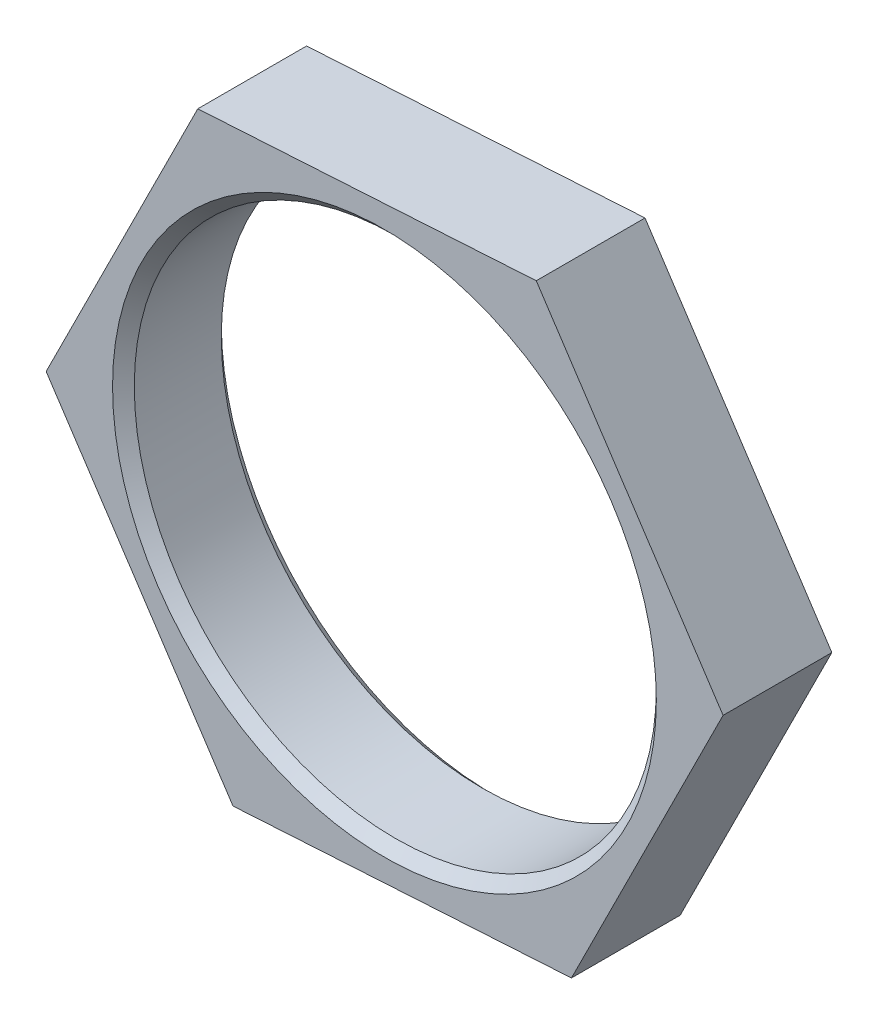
ISO-10303-21;
HEADER;
FILE_DESCRIPTION(('STEP AP214'),'2;1');
FILE_NAME('part.step','',(''),(''),'','','');
FILE_SCHEMA(('AUTOMOTIVE_DESIGN { 1 0 10303 214 1 1 1 1 }'));
ENDSEC;
DATA;
#1=APPLICATION_CONTEXT('core data for automotive mechanical design processes');
#2=APPLICATION_PROTOCOL_DEFINITION('international standard','automotive_design',2000,#1);
#3=PRODUCT_CONTEXT('',#1,'mechanical');
#4=PRODUCT('Part','Part','',(#3));
#5=PRODUCT_RELATED_PRODUCT_CATEGORY('part','',(#4));
#6=PRODUCT_DEFINITION_FORMATION('','',#4);
#7=PRODUCT_DEFINITION_CONTEXT('part definition',#1,'design');
#8=PRODUCT_DEFINITION('design','',#6,#7);
#9=PRODUCT_DEFINITION_SHAPE('','',#8);
#10=(LENGTH_UNIT() NAMED_UNIT(*) SI_UNIT(.MILLI.,.METRE.));
#11=(NAMED_UNIT(*) PLANE_ANGLE_UNIT() SI_UNIT($,.RADIAN.));
#12=(NAMED_UNIT(*) SI_UNIT($,.STERADIAN.) SOLID_ANGLE_UNIT());
#13=UNCERTAINTY_MEASURE_WITH_UNIT(LENGTH_MEASURE(1.E-05),#10,'distance_accuracy_value','');
#14=(GEOMETRIC_REPRESENTATION_CONTEXT(3) GLOBAL_UNCERTAINTY_ASSIGNED_CONTEXT((#13)) GLOBAL_UNIT_ASSIGNED_CONTEXT((#10,
#11,#12)) REPRESENTATION_CONTEXT('',''));
#15=CARTESIAN_POINT('',(0.,0.,0.));
#16=DIRECTION('',(0.,0.,1.));
#17=DIRECTION('',(1.,0.,0.));
#18=AXIS2_PLACEMENT_3D('',#15,#16,#17);
#19=CARTESIAN_POINT('',(15.5604520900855,0.933986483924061,5.));
#20=DIRECTION('',(-0.834511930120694,-0.550989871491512,0.));
#21=DIRECTION('',(0.550989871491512,-0.834511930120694,0.));
#22=AXIS2_PLACEMENT_3D('',#19,#20,#21);
#23=PLANE('',#22);
#24=DIRECTION('',(-0.550989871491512,0.834511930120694,0.));
#25=VECTOR('',#24,1.);
#26=CARTESIAN_POINT('',(15.5604520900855,0.933986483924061,0.));
#27=LINE('',#26,#25);
#28=CARTESIAN_POINT('',(15.5604520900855,0.933986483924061,0.));
#29=VERTEX_POINT('',#28);
#30=CARTESIAN_POINT('',(6.97137002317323,13.9427400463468,0.));
#31=VERTEX_POINT('',#30);
#32=EDGE_CURVE('E117',#29,#31,#27,.T.);
#33=ORIENTED_EDGE('',*,*,#32,.T.);
#34=DIRECTION('',(0.,0.,-1.));
#35=VECTOR('',#34,1.);
#36=CARTESIAN_POINT('',(6.97137002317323,13.9427400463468,5.));
#37=LINE('',#36,#35);
#38=CARTESIAN_POINT('',(6.97137002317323,13.9427400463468,5.));
#39=VERTEX_POINT('',#38);
#40=EDGE_CURVE('E134',#39,#31,#37,.T.);
#41=ORIENTED_EDGE('',*,*,#40,.F.);
#42=DIRECTION('',(-0.550989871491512,0.834511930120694,0.));
#43=VECTOR('',#42,1.);
#44=CARTESIAN_POINT('',(15.5604520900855,0.933986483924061,5.));
#45=LINE('',#44,#43);
#46=CARTESIAN_POINT('',(15.5604520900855,0.933986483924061,5.));
#47=VERTEX_POINT('',#46);
#48=EDGE_CURVE('E127',#47,#39,#45,.T.);
#49=ORIENTED_EDGE('',*,*,#48,.F.);
#50=DIRECTION('',(0.,0.,-1.));
#51=VECTOR('',#50,1.);
#52=CARTESIAN_POINT('',(15.5604520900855,0.933986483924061,5.));
#53=LINE('',#52,#51);
#54=EDGE_CURVE('E113',#47,#29,#53,.T.);
#55=ORIENTED_EDGE('',*,*,#54,.T.);
#56=EDGE_LOOP('',(#33,#41,#49,#55));
#57=FACE_BOUND('',#56,.T.);
#58=ADVANCED_FACE('F31',(#57),#23,.F.);
#59=CARTESIAN_POINT('',(6.97137002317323,13.9427400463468,5.));
#60=DIRECTION('',(0.0599152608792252,-0.998203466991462,0.));
#61=DIRECTION('',(0.998203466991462,0.0599152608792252,0.));
#62=AXIS2_PLACEMENT_3D('',#59,#60,#61);
#63=PLANE('',#62);
#64=DIRECTION('',(-0.998203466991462,-0.0599152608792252,0.));
#65=VECTOR('',#64,1.);
#66=CARTESIAN_POINT('',(6.97137002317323,13.9427400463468,0.));
#67=LINE('',#66,#65);
#68=CARTESIAN_POINT('',(-8.58908206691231,13.0087535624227,0.));
#69=VERTEX_POINT('',#68);
#70=EDGE_CURVE('E120',#31,#69,#67,.T.);
#71=ORIENTED_EDGE('',*,*,#70,.T.);
#72=DIRECTION('',(0.,0.,-1.));
#73=VECTOR('',#72,1.);
#74=CARTESIAN_POINT('',(-8.58908206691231,13.0087535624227,5.));
#75=LINE('',#74,#73);
#76=CARTESIAN_POINT('',(-8.58908206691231,13.0087535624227,5.));
#77=VERTEX_POINT('',#76);
#78=EDGE_CURVE('E131',#77,#69,#75,.T.);
#79=ORIENTED_EDGE('',*,*,#78,.F.);
#80=DIRECTION('',(-0.998203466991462,-0.0599152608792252,0.));
#81=VECTOR('',#80,1.);
#82=CARTESIAN_POINT('',(6.97137002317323,13.9427400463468,5.));
#83=LINE('',#82,#81);
#84=EDGE_CURVE('E86',#39,#77,#83,.T.);
#85=ORIENTED_EDGE('',*,*,#84,.F.);
#86=ORIENTED_EDGE('',*,*,#40,.T.);
#87=EDGE_LOOP('',(#71,#79,#85,#86));
#88=FACE_BOUND('',#87,.T.);
#89=ADVANCED_FACE('F164',(#88),#63,.F.);
#90=CARTESIAN_POINT('',(-8.58908206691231,13.0087535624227,5.));
#91=DIRECTION('',(0.89442719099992,-0.44721359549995,0.));
#92=DIRECTION('',(0.44721359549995,0.89442719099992,0.));
#93=AXIS2_PLACEMENT_3D('',#90,#91,#92);
#94=PLANE('',#93);
#95=DIRECTION('',(-0.44721359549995,-0.89442719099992,0.));
#96=VECTOR('',#95,1.);
#97=CARTESIAN_POINT('',(-8.58908206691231,13.0087535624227,0.));
#98=LINE('',#97,#96);
#99=CARTESIAN_POINT('',(-15.5604520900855,-0.933986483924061,0.));
#100=VERTEX_POINT('',#99);
#101=EDGE_CURVE('E122',#69,#100,#98,.T.);
#102=ORIENTED_EDGE('',*,*,#101,.T.);
#103=DIRECTION('',(0.,0.,-1.));
#104=VECTOR('',#103,1.);
#105=CARTESIAN_POINT('',(-15.5604520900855,-0.933986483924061,5.));
#106=LINE('',#105,#104);
#107=CARTESIAN_POINT('',(-15.5604520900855,-0.933986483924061,5.));
#108=VERTEX_POINT('',#107);
#109=EDGE_CURVE('E108',#108,#100,#106,.T.);
#110=ORIENTED_EDGE('',*,*,#109,.F.);
#111=DIRECTION('',(-0.44721359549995,-0.89442719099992,0.));
#112=VECTOR('',#111,1.);
#113=CARTESIAN_POINT('',(-8.58908206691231,13.0087535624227,5.));
#114=LINE('',#113,#112);
#115=EDGE_CURVE('E99',#77,#108,#114,.T.);
#116=ORIENTED_EDGE('',*,*,#115,.F.);
#117=ORIENTED_EDGE('',*,*,#78,.T.);
#118=EDGE_LOOP('',(#102,#110,#116,#117));
#119=FACE_BOUND('',#118,.T.);
#120=ADVANCED_FACE('F170',(#119),#94,.F.);
#121=CARTESIAN_POINT('',(-15.5604520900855,-0.933986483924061,5.));
#122=DIRECTION('',(0.834511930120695,0.550989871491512,0.));
#123=DIRECTION('',(-0.550989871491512,0.834511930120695,0.));
#124=AXIS2_PLACEMENT_3D('',#121,#122,#123);
#125=PLANE('',#124);
#126=DIRECTION('',(0.550989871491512,-0.834511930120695,0.));
#127=VECTOR('',#126,1.);
#128=CARTESIAN_POINT('',(-15.5604520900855,-0.933986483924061,0.));
#129=LINE('',#128,#127);
#130=CARTESIAN_POINT('',(-6.97137002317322,-13.9427400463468,0.));
#131=VERTEX_POINT('',#130);
#132=EDGE_CURVE('E107',#100,#131,#129,.T.);
#133=ORIENTED_EDGE('',*,*,#132,.T.);
#134=DIRECTION('',(0.,0.,-1.));
#135=VECTOR('',#134,1.);
#136=CARTESIAN_POINT('',(-6.97137002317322,-13.9427400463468,5.));
#137=LINE('',#136,#135);
#138=CARTESIAN_POINT('',(-6.97137002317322,-13.9427400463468,5.));
#139=VERTEX_POINT('',#138);
#140=EDGE_CURVE('E104',#139,#131,#137,.T.);
#141=ORIENTED_EDGE('',*,*,#140,.F.);
#142=DIRECTION('',(0.550989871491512,-0.834511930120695,0.));
#143=VECTOR('',#142,1.);
#144=CARTESIAN_POINT('',(-15.5604520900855,-0.933986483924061,5.));
#145=LINE('',#144,#143);
#146=EDGE_CURVE('E93',#108,#139,#145,.T.);
#147=ORIENTED_EDGE('',*,*,#146,.F.);
#148=ORIENTED_EDGE('',*,*,#109,.T.);
#149=EDGE_LOOP('',(#133,#141,#147,#148));
#150=FACE_BOUND('',#149,.T.);
#151=ADVANCED_FACE('F105',(#150),#125,.F.);
#152=CARTESIAN_POINT('',(-6.97137002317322,-13.9427400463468,5.));
#153=DIRECTION('',(-0.0599152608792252,0.998203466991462,0.));
#154=DIRECTION('',(-0.998203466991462,-0.0599152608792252,0.));
#155=AXIS2_PLACEMENT_3D('',#152,#153,#154);
#156=PLANE('',#155);
#157=DIRECTION('',(0.998203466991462,0.0599152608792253,0.));
#158=VECTOR('',#157,1.);
#159=CARTESIAN_POINT('',(-6.97137002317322,-13.9427400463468,0.));
#160=LINE('',#159,#158);
#161=CARTESIAN_POINT('',(8.58908206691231,-13.0087535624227,0.));
#162=VERTEX_POINT('',#161);
#163=EDGE_CURVE('E71',#131,#162,#160,.T.);
#164=ORIENTED_EDGE('',*,*,#163,.T.);
#165=DIRECTION('',(0.,0.,-1.));
#166=VECTOR('',#165,1.);
#167=CARTESIAN_POINT('',(8.58908206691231,-13.0087535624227,5.));
#168=LINE('',#167,#166);
#169=CARTESIAN_POINT('',(8.58908206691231,-13.0087535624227,5.));
#170=VERTEX_POINT('',#169);
#171=EDGE_CURVE('E109',#170,#162,#168,.T.);
#172=ORIENTED_EDGE('',*,*,#171,.F.);
#173=DIRECTION('',(0.998203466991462,0.0599152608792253,0.));
#174=VECTOR('',#173,1.);
#175=CARTESIAN_POINT('',(-6.97137002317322,-13.9427400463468,5.));
#176=LINE('',#175,#174);
#177=EDGE_CURVE('E97',#139,#170,#176,.T.);
#178=ORIENTED_EDGE('',*,*,#177,.F.);
#179=ORIENTED_EDGE('',*,*,#140,.T.);
#180=EDGE_LOOP('',(#164,#172,#178,#179));
#181=FACE_BOUND('',#180,.T.);
#182=ADVANCED_FACE('F111',(#181),#156,.F.);
#183=CARTESIAN_POINT('',(8.58908206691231,-13.0087535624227,5.));
#184=DIRECTION('',(-0.89442719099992,0.44721359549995,0.));
#185=DIRECTION('',(-0.44721359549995,-0.89442719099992,0.));
#186=AXIS2_PLACEMENT_3D('',#183,#184,#185);
#187=PLANE('',#186);
#188=DIRECTION('',(0.44721359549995,0.89442719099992,0.));
#189=VECTOR('',#188,1.);
#190=CARTESIAN_POINT('',(8.58908206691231,-13.0087535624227,0.));
#191=LINE('',#190,#189);
#192=EDGE_CURVE('E77',#162,#29,#191,.T.);
#193=ORIENTED_EDGE('',*,*,#192,.T.);
#194=ORIENTED_EDGE('',*,*,#54,.F.);
#195=DIRECTION('',(0.44721359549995,0.89442719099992,0.));
#196=VECTOR('',#195,1.);
#197=CARTESIAN_POINT('',(8.58908206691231,-13.0087535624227,5.));
#198=LINE('',#197,#196);
#199=EDGE_CURVE('E48',#170,#47,#198,.T.);
#200=ORIENTED_EDGE('',*,*,#199,.F.);
#201=ORIENTED_EDGE('',*,*,#171,.T.);
#202=EDGE_LOOP('',(#193,#194,#200,#201));
#203=FACE_BOUND('',#202,.T.);
#204=ADVANCED_FACE('F180',(#203),#187,.F.);
#205=CARTESIAN_POINT('',(15.5604520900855,0.93398648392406,5.));
#206=DIRECTION('',(0.,0.,-1.));
#207=DIRECTION('',(-1.,0.,0.));
#208=AXIS2_PLACEMENT_3D('',#205,#206,#207);
#209=PLANE('',#208);
#210=CARTESIAN_POINT('',(-0.00844207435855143,-0.000506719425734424,5.));
#211=DIRECTION('',(0.,0.,-1.));
#212=DIRECTION('',(-1.,0.,0.));
#213=AXIS2_PLACEMENT_3D('',#210,#211,#212);
#214=CIRCLE('',#213,12.5);
#215=CARTESIAN_POINT('',(-12.5084420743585,-0.000506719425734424,5.));
#216=VERTEX_POINT('',#215);
#217=EDGE_CURVE('E11',#216,#216,#214,.T.);
#218=ORIENTED_EDGE('',*,*,#217,.T.);
#219=EDGE_LOOP('',(#218));
#220=FACE_BOUND('',#219,.T.);
#221=ORIENTED_EDGE('',*,*,#48,.T.);
#222=ORIENTED_EDGE('',*,*,#84,.T.);
#223=ORIENTED_EDGE('',*,*,#115,.T.);
#224=ORIENTED_EDGE('',*,*,#146,.T.);
#225=ORIENTED_EDGE('',*,*,#177,.T.);
#226=ORIENTED_EDGE('',*,*,#199,.T.);
#227=EDGE_LOOP('',(#221,#222,#223,#224,#225,#226));
#228=FACE_BOUND('',#227,.T.);
#229=ADVANCED_FACE('F95',(#220,#228),#209,.F.);
#230=CARTESIAN_POINT('',(15.5604520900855,0.93398648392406,0.));
#231=DIRECTION('',(0.,0.,-1.));
#232=DIRECTION('',(-1.,0.,0.));
#233=AXIS2_PLACEMENT_3D('',#230,#231,#232);
#234=PLANE('',#233);
#235=CARTESIAN_POINT('',(-0.00844207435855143,-0.000506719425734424,0.));
#236=DIRECTION('',(0.,0.,-1.));
#237=DIRECTION('',(-1.,0.,0.));
#238=AXIS2_PLACEMENT_3D('',#235,#236,#237);
#239=CIRCLE('',#238,12.5);
#240=CARTESIAN_POINT('',(-12.5084420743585,-0.000506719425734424,0.));
#241=VERTEX_POINT('',#240);
#242=EDGE_CURVE('E40',#241,#241,#239,.F.);
#243=ORIENTED_EDGE('',*,*,#242,.T.);
#244=EDGE_LOOP('',(#243));
#245=FACE_BOUND('',#244,.T.);
#246=ORIENTED_EDGE('',*,*,#32,.F.);
#247=ORIENTED_EDGE('',*,*,#192,.F.);
#248=ORIENTED_EDGE('',*,*,#163,.F.);
#249=ORIENTED_EDGE('',*,*,#132,.F.);
#250=ORIENTED_EDGE('',*,*,#101,.F.);
#251=ORIENTED_EDGE('',*,*,#70,.F.);
#252=EDGE_LOOP('',(#246,#247,#248,#249,#250,#251));
#253=FACE_BOUND('',#252,.T.);
#254=ADVANCED_FACE('F144',(#245,#253),#234,.T.);
#255=CARTESIAN_POINT('',(-0.00844207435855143,-0.000506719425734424,5.));
#256=DIRECTION('',(0.,0.,1.));
#257=DIRECTION('',(1.,0.,0.));
#258=AXIS2_PLACEMENT_3D('',#255,#256,#257);
#259=CYLINDRICAL_SURFACE('',#258,12.);
#260=CARTESIAN_POINT('',(-0.00844207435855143,-0.000506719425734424,0.499999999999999));
#261=DIRECTION('',(0.,0.,-1.));
#262=DIRECTION('',(-1.,0.,0.));
#263=AXIS2_PLACEMENT_3D('',#260,#261,#262);
#264=CIRCLE('',#263,12.);
#265=CARTESIAN_POINT('',(-12.0084420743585,-0.000506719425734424,0.499999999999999));
#266=VERTEX_POINT('',#265);
#267=EDGE_CURVE('E139',#266,#266,#264,.T.);
#268=ORIENTED_EDGE('',*,*,#267,.T.);
#269=EDGE_LOOP('',(#268));
#270=FACE_BOUND('',#269,.T.);
#271=CARTESIAN_POINT('',(-0.00844207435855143,-0.000506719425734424,4.5));
#272=DIRECTION('',(0.,0.,-1.));
#273=DIRECTION('',(-1.,0.,0.));
#274=AXIS2_PLACEMENT_3D('',#271,#272,#273);
#275=CIRCLE('',#274,12.);
#276=CARTESIAN_POINT('',(-12.0084420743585,-0.000506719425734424,4.5));
#277=VERTEX_POINT('',#276);
#278=EDGE_CURVE('E136',#277,#277,#275,.F.);
#279=ORIENTED_EDGE('',*,*,#278,.T.);
#280=EDGE_LOOP('',(#279));
#281=FACE_BOUND('',#280,.T.);
#282=ADVANCED_FACE('F150',(#270,#281),#259,.F.);
#283=CARTESIAN_POINT('',(-0.00844207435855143,-0.000506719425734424,0.499999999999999));
#284=DIRECTION('',(0.,0.,-1.));
#285=DIRECTION('',(-1.,0.,0.));
#286=AXIS2_PLACEMENT_3D('',#283,#284,#285);
#287=CONICAL_SURFACE('',#286,12.,0.78539816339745);
#288=ORIENTED_EDGE('',*,*,#242,.F.);
#289=EDGE_LOOP('',(#288));
#290=FACE_BOUND('',#289,.T.);
#291=ORIENTED_EDGE('',*,*,#267,.F.);
#292=EDGE_LOOP('',(#291));
#293=FACE_BOUND('',#292,.T.);
#294=ADVANCED_FACE('F147',(#290,#293),#287,.F.);
#295=CARTESIAN_POINT('',(-0.00844207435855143,-0.000506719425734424,4.5));
#296=DIRECTION('',(0.,0.,1.));
#297=DIRECTION('',(1.,0.,0.));
#298=AXIS2_PLACEMENT_3D('',#295,#296,#297);
#299=CONICAL_SURFACE('',#298,12.,0.78539816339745);
#300=ORIENTED_EDGE('',*,*,#217,.F.);
#301=EDGE_LOOP('',(#300));
#302=FACE_BOUND('',#301,.T.);
#303=ORIENTED_EDGE('',*,*,#278,.F.);
#304=EDGE_LOOP('',(#303));
#305=FACE_BOUND('',#304,.T.);
#306=ADVANCED_FACE('F33',(#302,#305),#299,.F.);
#307=CLOSED_SHELL('',(#58,#89,#120,#151,#182,#204,#229,#254,#282,#294,#306));
#308=MANIFOLD_SOLID_BREP('B2',#307);
#309=ADVANCED_BREP_SHAPE_REPRESENTATION('',(#18,#308),#14);
#310=SHAPE_DEFINITION_REPRESENTATION(#9,#309);
ENDSEC;
END-ISO-10303-21;
